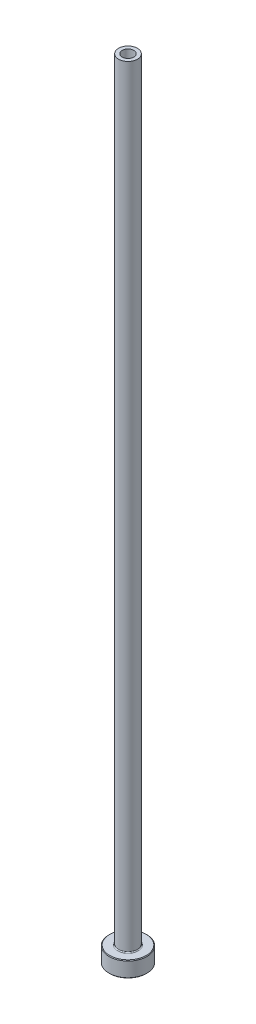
ISO-10303-21;
HEADER;
FILE_DESCRIPTION(('STEP AP214'),'2;1');
FILE_NAME('part.step','',(''),(''),'','','');
FILE_SCHEMA(('AUTOMOTIVE_DESIGN { 1 0 10303 214 1 1 1 1 }'));
ENDSEC;
DATA;
#1=APPLICATION_CONTEXT('core data for automotive mechanical design processes');
#2=APPLICATION_PROTOCOL_DEFINITION('international standard','automotive_design',2000,#1);
#3=PRODUCT_CONTEXT('',#1,'mechanical');
#4=PRODUCT('Part','Part','',(#3));
#5=PRODUCT_RELATED_PRODUCT_CATEGORY('part','',(#4));
#6=PRODUCT_DEFINITION_FORMATION('','',#4);
#7=PRODUCT_DEFINITION_CONTEXT('part definition',#1,'design');
#8=PRODUCT_DEFINITION('design','',#6,#7);
#9=PRODUCT_DEFINITION_SHAPE('','',#8);
#10=(LENGTH_UNIT() NAMED_UNIT(*) SI_UNIT(.MILLI.,.METRE.));
#11=(NAMED_UNIT(*) PLANE_ANGLE_UNIT() SI_UNIT($,.RADIAN.));
#12=(NAMED_UNIT(*) SI_UNIT($,.STERADIAN.) SOLID_ANGLE_UNIT());
#13=UNCERTAINTY_MEASURE_WITH_UNIT(LENGTH_MEASURE(1.E-05),#10,'distance_accuracy_value','');
#14=(GEOMETRIC_REPRESENTATION_CONTEXT(3) GLOBAL_UNCERTAINTY_ASSIGNED_CONTEXT((#13)) GLOBAL_UNIT_ASSIGNED_CONTEXT((#10,
#11,#12)) REPRESENTATION_CONTEXT('',''));
#15=CARTESIAN_POINT('',(0.,0.,0.));
#16=DIRECTION('',(0.,0.,1.));
#17=DIRECTION('',(1.,0.,0.));
#18=AXIS2_PLACEMENT_3D('',#15,#16,#17);
#19=CARTESIAN_POINT('',(0.,92.1876809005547,0.));
#20=DIRECTION('',(0.,1.,0.));
#21=DIRECTION('',(0.,0.,1.));
#22=AXIS2_PLACEMENT_3D('',#19,#20,#21);
#23=CYLINDRICAL_SURFACE('',#22,1.85000000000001);
#24=CARTESIAN_POINT('',(0.,250.,0.));
#25=DIRECTION('',(0.,1.,0.));
#26=DIRECTION('',(0.,0.,1.));
#27=AXIS2_PLACEMENT_3D('',#24,#25,#26);
#28=CIRCLE('',#27,1.85000000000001);
#29=CARTESIAN_POINT('',(0.,250.,1.85000000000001));
#30=VERTEX_POINT('',#29);
#31=EDGE_CURVE('E62',#30,#30,#28,.T.);
#32=ORIENTED_EDGE('',*,*,#31,.T.);
#33=EDGE_LOOP('',(#32));
#34=FACE_BOUND('',#33,.T.);
#35=CARTESIAN_POINT('',(0.,205.,0.));
#36=DIRECTION('',(0.,1.,0.));
#37=DIRECTION('',(0.,0.,1.));
#38=AXIS2_PLACEMENT_3D('',#35,#36,#37);
#39=CIRCLE('',#38,1.85000000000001);
#40=CARTESIAN_POINT('',(0.,205.,1.85000000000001));
#41=VERTEX_POINT('',#40);
#42=EDGE_CURVE('E71',#41,#41,#39,.T.);
#43=ORIENTED_EDGE('',*,*,#42,.F.);
#44=EDGE_LOOP('',(#43));
#45=FACE_BOUND('',#44,.T.);
#46=ADVANCED_FACE('F30',(#34,#45),#23,.F.);
#47=CARTESIAN_POINT('',(-1.85000000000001,250.,0.));
#48=DIRECTION('',(0.,1.,0.));
#49=DIRECTION('',(0.,0.,1.));
#50=AXIS2_PLACEMENT_3D('',#47,#48,#49);
#51=PLANE('',#50);
#52=CARTESIAN_POINT('',(0.,250.,0.));
#53=DIRECTION('',(0.,1.,0.));
#54=DIRECTION('',(0.,0.,1.));
#55=AXIS2_PLACEMENT_3D('',#52,#53,#54);
#56=CIRCLE('',#55,3.00000000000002);
#57=CARTESIAN_POINT('',(0.,250.,3.00000000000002));
#58=VERTEX_POINT('',#57);
#59=EDGE_CURVE('E65',#58,#58,#56,.T.);
#60=ORIENTED_EDGE('',*,*,#59,.T.);
#61=EDGE_LOOP('',(#60));
#62=FACE_BOUND('',#61,.T.);
#63=ORIENTED_EDGE('',*,*,#31,.F.);
#64=EDGE_LOOP('',(#63));
#65=FACE_BOUND('',#64,.T.);
#66=ADVANCED_FACE('F79',(#62,#65),#51,.T.);
#67=CARTESIAN_POINT('',(0.,92.1876809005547,0.));
#68=DIRECTION('',(0.,1.,0.));
#69=DIRECTION('',(0.,0.,1.));
#70=AXIS2_PLACEMENT_3D('',#67,#68,#69);
#71=CYLINDRICAL_SURFACE('',#70,3.);
#72=CARTESIAN_POINT('',(0.,5.3,0.));
#73=DIRECTION('',(0.,1.,0.));
#74=DIRECTION('',(0.,0.,1.));
#75=AXIS2_PLACEMENT_3D('',#72,#73,#74);
#76=CIRCLE('',#75,3.);
#77=CARTESIAN_POINT('',(0.,5.3,3.));
#78=VERTEX_POINT('',#77);
#79=EDGE_CURVE('E59',#78,#78,#76,.T.);
#80=ORIENTED_EDGE('',*,*,#79,.T.);
#81=EDGE_LOOP('',(#80));
#82=FACE_BOUND('',#81,.T.);
#83=ORIENTED_EDGE('',*,*,#59,.F.);
#84=EDGE_LOOP('',(#83));
#85=FACE_BOUND('',#84,.T.);
#86=ADVANCED_FACE('F85',(#82,#85),#71,.T.);
#87=CARTESIAN_POINT('',(-2.99999999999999,5.,0.));
#88=DIRECTION('',(0.,1.,0.));
#89=DIRECTION('',(0.,0.,1.));
#90=AXIS2_PLACEMENT_3D('',#87,#88,#89);
#91=PLANE('',#90);
#92=CARTESIAN_POINT('',(0.,5.,0.));
#93=DIRECTION('',(0.,1.,0.));
#94=DIRECTION('',(0.,0.,1.));
#95=AXIS2_PLACEMENT_3D('',#92,#93,#94);
#96=CIRCLE('',#95,5.79999999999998);
#97=CARTESIAN_POINT('',(0.,5.,5.79999999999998));
#98=VERTEX_POINT('',#97);
#99=EDGE_CURVE('E53',#98,#98,#96,.T.);
#100=ORIENTED_EDGE('',*,*,#99,.T.);
#101=EDGE_LOOP('',(#100));
#102=FACE_BOUND('',#101,.T.);
#103=CARTESIAN_POINT('',(0.,5.,0.));
#104=DIRECTION('',(0.,1.,0.));
#105=DIRECTION('',(0.,0.,1.));
#106=AXIS2_PLACEMENT_3D('',#103,#104,#105);
#107=CIRCLE('',#106,3.3);
#108=CARTESIAN_POINT('',(0.,5.,3.3));
#109=VERTEX_POINT('',#108);
#110=EDGE_CURVE('E56',#109,#109,#107,.F.);
#111=ORIENTED_EDGE('',*,*,#110,.T.);
#112=EDGE_LOOP('',(#111));
#113=FACE_BOUND('',#112,.T.);
#114=ADVANCED_FACE('F111',(#102,#113),#91,.T.);
#115=CARTESIAN_POINT('',(0.,92.1876809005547,0.));
#116=DIRECTION('',(0.,1.,0.));
#117=DIRECTION('',(0.,0.,1.));
#118=AXIS2_PLACEMENT_3D('',#115,#116,#117);
#119=CYLINDRICAL_SURFACE('',#118,5.99999999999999);
#120=CARTESIAN_POINT('',(0.,4.79999999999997,0.));
#121=DIRECTION('',(0.,1.,0.));
#122=DIRECTION('',(0.,0.,1.));
#123=AXIS2_PLACEMENT_3D('',#120,#121,#122);
#124=CIRCLE('',#123,5.99999999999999);
#125=CARTESIAN_POINT('',(0.,4.79999999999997,5.99999999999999));
#126=VERTEX_POINT('',#125);
#127=EDGE_CURVE('E45',#126,#126,#124,.F.);
#128=ORIENTED_EDGE('',*,*,#127,.T.);
#129=EDGE_LOOP('',(#128));
#130=FACE_BOUND('',#129,.T.);
#131=CARTESIAN_POINT('',(0.,0.199999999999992,0.));
#132=DIRECTION('',(0.,-1.,0.));
#133=DIRECTION('',(0.,0.,-1.));
#134=AXIS2_PLACEMENT_3D('',#131,#132,#133);
#135=CIRCLE('',#134,5.99999999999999);
#136=CARTESIAN_POINT('',(0.,0.199999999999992,-5.99999999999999));
#137=VERTEX_POINT('',#136);
#138=EDGE_CURVE('E50',#137,#137,#135,.F.);
#139=ORIENTED_EDGE('',*,*,#138,.T.);
#140=EDGE_LOOP('',(#139));
#141=FACE_BOUND('',#140,.T.);
#142=ADVANCED_FACE('F108',(#130,#141),#119,.T.);
#143=CARTESIAN_POINT('',(-5.99999999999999,0.,0.));
#144=DIRECTION('',(0.,-1.,0.));
#145=DIRECTION('',(0.,0.,-1.));
#146=AXIS2_PLACEMENT_3D('',#143,#144,#145);
#147=PLANE('',#146);
#148=CARTESIAN_POINT('',(0.,0.,0.));
#149=DIRECTION('',(0.,-1.,0.));
#150=DIRECTION('',(0.,0.,-1.));
#151=AXIS2_PLACEMENT_3D('',#148,#149,#150);
#152=CIRCLE('',#151,2.59999999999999);
#153=CARTESIAN_POINT('',(0.,0.,-2.59999999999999));
#154=VERTEX_POINT('',#153);
#155=EDGE_CURVE('E37',#154,#154,#152,.F.);
#156=ORIENTED_EDGE('',*,*,#155,.T.);
#157=EDGE_LOOP('',(#156));
#158=FACE_BOUND('',#157,.T.);
#159=CARTESIAN_POINT('',(0.,0.,0.));
#160=DIRECTION('',(0.,-1.,0.));
#161=DIRECTION('',(0.,0.,-1.));
#162=AXIS2_PLACEMENT_3D('',#159,#160,#161);
#163=CIRCLE('',#162,5.8);
#164=CARTESIAN_POINT('',(0.,0.,-5.8));
#165=VERTEX_POINT('',#164);
#166=EDGE_CURVE('E41',#165,#165,#163,.T.);
#167=ORIENTED_EDGE('',*,*,#166,.T.);
#168=EDGE_LOOP('',(#167));
#169=FACE_BOUND('',#168,.T.);
#170=ADVANCED_FACE('F110',(#158,#169),#147,.T.);
#171=CARTESIAN_POINT('',(0.,92.1876809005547,0.));
#172=DIRECTION('',(0.,1.,0.));
#173=DIRECTION('',(0.,0.,1.));
#174=AXIS2_PLACEMENT_3D('',#171,#172,#173);
#175=CYLINDRICAL_SURFACE('',#174,2.1);
#176=CARTESIAN_POINT('',(0.,0.500000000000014,0.));
#177=DIRECTION('',(0.,-1.,0.));
#178=DIRECTION('',(0.,0.,-1.));
#179=AXIS2_PLACEMENT_3D('',#176,#177,#178);
#180=CIRCLE('',#179,2.1);
#181=CARTESIAN_POINT('',(0.,0.500000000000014,-2.1));
#182=VERTEX_POINT('',#181);
#183=EDGE_CURVE('E10',#182,#182,#180,.T.);
#184=ORIENTED_EDGE('',*,*,#183,.T.);
#185=EDGE_LOOP('',(#184));
#186=FACE_BOUND('',#185,.T.);
#187=CARTESIAN_POINT('',(0.,193.,0.));
#188=DIRECTION('',(0.,1.,0.));
#189=DIRECTION('',(0.,0.,1.));
#190=AXIS2_PLACEMENT_3D('',#187,#188,#189);
#191=CIRCLE('',#190,2.10000000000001);
#192=CARTESIAN_POINT('',(0.,193.,2.10000000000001));
#193=VERTEX_POINT('',#192);
#194=EDGE_CURVE('E68',#193,#193,#191,.T.);
#195=ORIENTED_EDGE('',*,*,#194,.T.);
#196=EDGE_LOOP('',(#195));
#197=FACE_BOUND('',#196,.T.);
#198=ADVANCED_FACE('F118',(#186,#197),#175,.F.);
#199=CARTESIAN_POINT('',(0.,193.,0.));
#200=DIRECTION('',(0.,-1.,0.));
#201=DIRECTION('',(0.,0.,-1.));
#202=AXIS2_PLACEMENT_3D('',#199,#200,#201);
#203=CONICAL_SURFACE('',#202,2.10000000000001,0.0208303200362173);
#204=ORIENTED_EDGE('',*,*,#42,.T.);
#205=EDGE_LOOP('',(#204));
#206=FACE_BOUND('',#205,.T.);
#207=ORIENTED_EDGE('',*,*,#194,.F.);
#208=EDGE_LOOP('',(#207));
#209=FACE_BOUND('',#208,.T.);
#210=ADVANCED_FACE('F75',(#206,#209),#203,.F.);
#211=CARTESIAN_POINT('',(0.,5.3,0.));
#212=DIRECTION('',(0.,1.,0.));
#213=DIRECTION('',(0.,0.,1.));
#214=AXIS2_PLACEMENT_3D('',#211,#212,#213);
#215=TOROIDAL_SURFACE('',#214,3.3,0.3);
#216=ORIENTED_EDGE('',*,*,#110,.F.);
#217=EDGE_LOOP('',(#216));
#218=FACE_BOUND('',#217,.T.);
#219=ORIENTED_EDGE('',*,*,#79,.F.);
#220=EDGE_LOOP('',(#219));
#221=FACE_BOUND('',#220,.T.);
#222=ADVANCED_FACE('F90',(#218,#221),#215,.F.);
#223=CARTESIAN_POINT('',(0.,5.,0.));
#224=DIRECTION('',(0.,-1.,0.));
#225=DIRECTION('',(0.,0.,-1.));
#226=AXIS2_PLACEMENT_3D('',#223,#224,#225);
#227=CONICAL_SURFACE('',#226,5.79999999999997,0.785398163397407);
#228=ORIENTED_EDGE('',*,*,#127,.F.);
#229=EDGE_LOOP('',(#228));
#230=FACE_BOUND('',#229,.T.);
#231=ORIENTED_EDGE('',*,*,#99,.F.);
#232=EDGE_LOOP('',(#231));
#233=FACE_BOUND('',#232,.T.);
#234=ADVANCED_FACE('F93',(#230,#233),#227,.T.);
#235=CARTESIAN_POINT('',(0.,0.199999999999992,0.));
#236=DIRECTION('',(0.,1.,0.));
#237=DIRECTION('',(0.,0.,1.));
#238=AXIS2_PLACEMENT_3D('',#235,#236,#237);
#239=CONICAL_SURFACE('',#238,5.99999999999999,0.78539816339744);
#240=ORIENTED_EDGE('',*,*,#166,.F.);
#241=EDGE_LOOP('',(#240));
#242=FACE_BOUND('',#241,.T.);
#243=ORIENTED_EDGE('',*,*,#138,.F.);
#244=EDGE_LOOP('',(#243));
#245=FACE_BOUND('',#244,.T.);
#246=ADVANCED_FACE('F96',(#242,#245),#239,.T.);
#247=CARTESIAN_POINT('',(0.,0.,0.));
#248=DIRECTION('',(0.,-1.,0.));
#249=DIRECTION('',(0.,0.,-1.));
#250=AXIS2_PLACEMENT_3D('',#247,#248,#249);
#251=CONICAL_SURFACE('',#250,2.59999999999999,0.785398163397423);
#252=ORIENTED_EDGE('',*,*,#183,.F.);
#253=EDGE_LOOP('',(#252));
#254=FACE_BOUND('',#253,.T.);
#255=ORIENTED_EDGE('',*,*,#155,.F.);
#256=EDGE_LOOP('',(#255));
#257=FACE_BOUND('',#256,.T.);
#258=ADVANCED_FACE('F32',(#254,#257),#251,.F.);
#259=CLOSED_SHELL('',(#46,#66,#86,#114,#142,#170,#198,#210,#222,#234,#246,#258));
#260=MANIFOLD_SOLID_BREP('B2',#259);
#261=ADVANCED_BREP_SHAPE_REPRESENTATION('',(#18,#260),#14);
#262=SHAPE_DEFINITION_REPRESENTATION(#9,#261);
ENDSEC;
END-ISO-10303-21;
